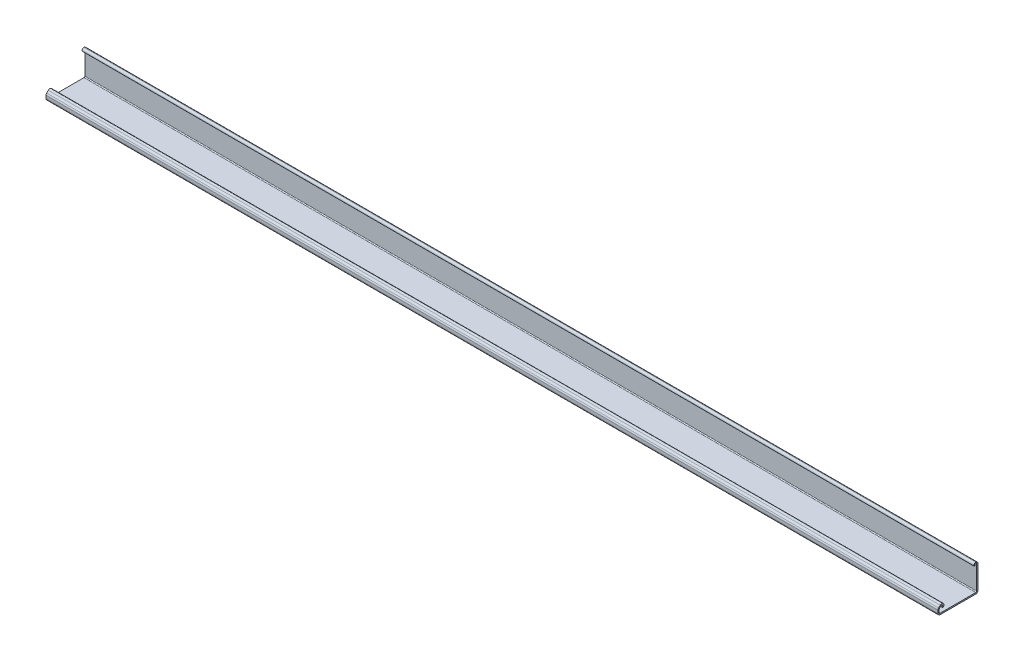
from build123d import *

# Parameters (mm, degrees)
MUUT_PROFIILIT_1_0057_LINEAARIN_PEITEPRO_DEPTH = 1000


with BuildPart() as part:
    # Sketch19 → Muut profiilit 1.0057 LINEAARIN PEITEPRO (new body)
    with BuildSketch(Plane.YZ):
        with BuildLine():
            Line((-6.105017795, 19.967393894), (-7.905387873, 21.767765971))
            ThreePointArc((-7.905387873, 21.767765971), (-8.716446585, 22.309698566), (-9.673155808, 22.5))
            Line((-9.673155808, 22.5), (-12.872784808, 22.5))
            ThreePointArc((-12.872784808, 22.5), (-14.64055176, 21.767766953), (-15.372784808, 20))
            Line((-15.372784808, 20), (-15.372784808, -20))
            ThreePointArc((-15.372784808, -20), (-14.64055176, -21.767766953), (-12.872784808, -22.5))
            Line((-12.872784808, -22.5), (13.127215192, -22.5))
            ThreePointArc((13.127215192, -22.5), (14.894982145, -21.767766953), (15.627215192, -20))
            ThreePointArc((15.627215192, -20), (14.63982785, -18.27529323), (12.652600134, -18.253539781))
            ThreePointArc((12.652600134, -18.253539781), (12.459639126, -18.933809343), (13.139908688, -19.126770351))
            ThreePointArc((13.139908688, -19.126770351), (14.133521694, -19.137647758), (14.627214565, -20.000000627))
            ThreePointArc((14.627214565, -20.000000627), (14.33432153, -20.707106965), (13.627215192, -21))
            Line((13.627215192, -21), (-12.872784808, -21))
            ThreePointArc((-12.872784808, -21), (-13.579891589, -20.707106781), (-13.872784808, -20))
            Line((-13.872784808, -20), (-13.872784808, 20))
            ThreePointArc((-13.872784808, 20), (-13.579891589, 20.707106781), (-12.872784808, 21))
            Line((-12.872784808, 21), (-9.673155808, 21))
            ThreePointArc((-9.673155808, 21), (-9.29047199, 20.923879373), (-8.966048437, 20.707106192))
            Line((-8.966048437, 20.707106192), (-7.16567886, 18.906733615))
            ThreePointArc((-7.16567886, 18.906733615), (-6.948906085, 18.582310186), (-6.87278561, 18.199626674))
            ThreePointArc((-6.87278561, 18.199626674), (-7.490102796, 17.275746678), (-8.579893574, 17.492520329))
            ThreePointArc((-8.579893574, 17.492520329), (-9.640554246, 17.492520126), (-9.640554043, 16.431859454))
            ThreePointArc((-9.640554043, 16.431859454), (-6.916077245, 15.889926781), (-5.372784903, 18.199626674))
            ThreePointArc((-5.372784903, 18.199626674), (-5.563086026, 19.156335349), (-6.105017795, 19.967393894))
        make_face()
    extrude(amount=MUUT_PROFIILIT_1_0057_LINEAARIN_PEITEPRO_DEPTH)


solid = part.part
